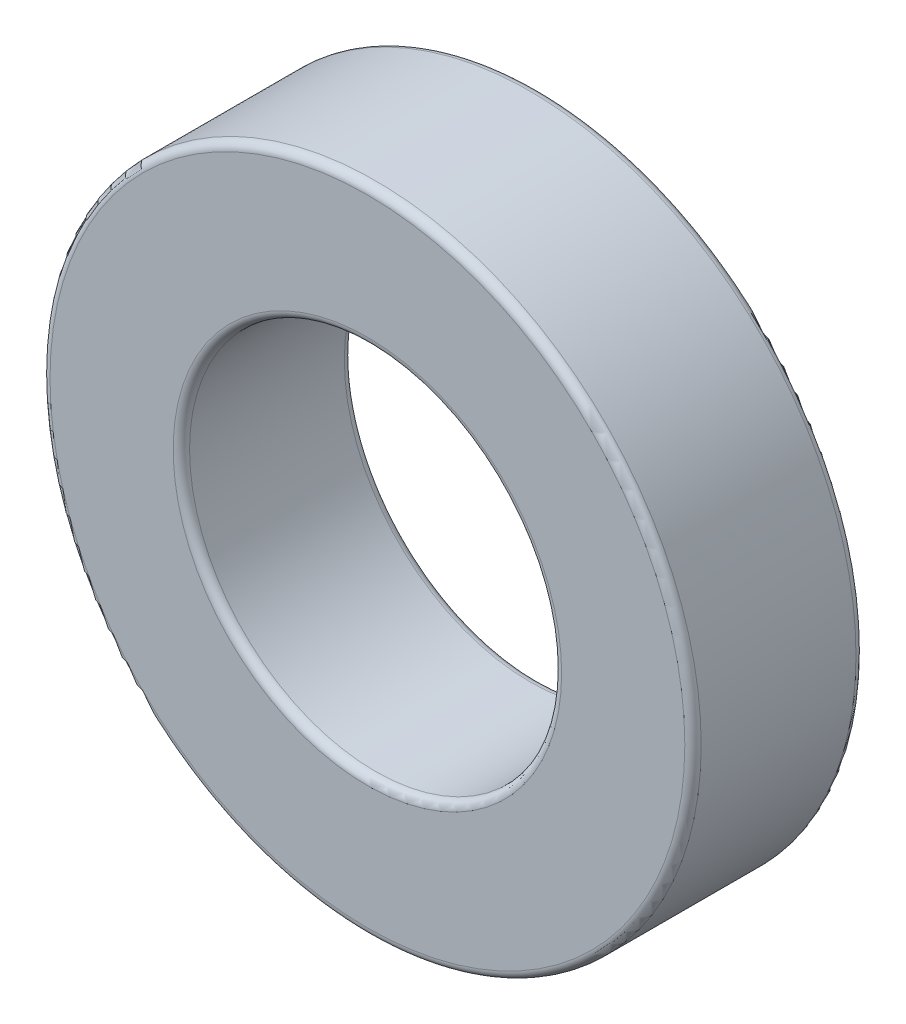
ISO-10303-21;
HEADER;
FILE_DESCRIPTION(('STEP AP214'),'2;1');
FILE_NAME('part.step','',(''),(''),'','','');
FILE_SCHEMA(('AUTOMOTIVE_DESIGN { 1 0 10303 214 1 1 1 1 }'));
ENDSEC;
DATA;
#1=APPLICATION_CONTEXT('core data for automotive mechanical design processes');
#2=APPLICATION_PROTOCOL_DEFINITION('international standard','automotive_design',2000,#1);
#3=PRODUCT_CONTEXT('',#1,'mechanical');
#4=PRODUCT('Part','Part','',(#3));
#5=PRODUCT_RELATED_PRODUCT_CATEGORY('part','',(#4));
#6=PRODUCT_DEFINITION_FORMATION('','',#4);
#7=PRODUCT_DEFINITION_CONTEXT('part definition',#1,'design');
#8=PRODUCT_DEFINITION('design','',#6,#7);
#9=PRODUCT_DEFINITION_SHAPE('','',#8);
#10=(LENGTH_UNIT() NAMED_UNIT(*) SI_UNIT(.MILLI.,.METRE.));
#11=(NAMED_UNIT(*) PLANE_ANGLE_UNIT() SI_UNIT($,.RADIAN.));
#12=(NAMED_UNIT(*) SI_UNIT($,.STERADIAN.) SOLID_ANGLE_UNIT());
#13=UNCERTAINTY_MEASURE_WITH_UNIT(LENGTH_MEASURE(1.E-05),#10,'distance_accuracy_value','');
#14=(GEOMETRIC_REPRESENTATION_CONTEXT(3) GLOBAL_UNCERTAINTY_ASSIGNED_CONTEXT((#13)) GLOBAL_UNIT_ASSIGNED_CONTEXT((#10,
#11,#12)) REPRESENTATION_CONTEXT('',''));
#15=CARTESIAN_POINT('',(0.,0.,0.));
#16=DIRECTION('',(0.,0.,1.));
#17=DIRECTION('',(1.,0.,0.));
#18=AXIS2_PLACEMENT_3D('',#15,#16,#17);
#19=CARTESIAN_POINT('',(0.,0.,-21.9));
#20=DIRECTION('',(0.,0.,1.));
#21=DIRECTION('',(1.,0.,0.));
#22=AXIS2_PLACEMENT_3D('',#19,#20,#21);
#23=TOROIDAL_SURFACE('',#22,42.65,1.1);
#24=CARTESIAN_POINT('',(0.,0.,-21.9));
#25=DIRECTION('',(0.,0.,1.));
#26=DIRECTION('',(1.,0.,0.));
#27=AXIS2_PLACEMENT_3D('',#24,#25,#26);
#28=CIRCLE('',#27,43.75);
#29=CARTESIAN_POINT('',(43.75,0.,-21.9));
#30=VERTEX_POINT('',#29);
#31=EDGE_CURVE('E10',#30,#30,#28,.T.);
#32=ORIENTED_EDGE('',*,*,#31,.F.);
#33=EDGE_LOOP('',(#32));
#34=FACE_BOUND('',#33,.T.);
#35=CARTESIAN_POINT('',(0.,0.,-23.));
#36=DIRECTION('',(0.,0.,1.));
#37=DIRECTION('',(1.,0.,0.));
#38=AXIS2_PLACEMENT_3D('',#35,#36,#37);
#39=CIRCLE('',#38,42.65);
#40=CARTESIAN_POINT('',(42.65,0.,-23.));
#41=VERTEX_POINT('',#40);
#42=EDGE_CURVE('E60',#41,#41,#39,.T.);
#43=ORIENTED_EDGE('',*,*,#42,.T.);
#44=EDGE_LOOP('',(#43));
#45=FACE_BOUND('',#44,.T.);
#46=ADVANCED_FACE('F32',(#34,#45),#23,.T.);
#47=CARTESIAN_POINT('',(0.,0.,80.));
#48=DIRECTION('',(0.,0.,1.));
#49=DIRECTION('',(1.,0.,0.));
#50=AXIS2_PLACEMENT_3D('',#47,#48,#49);
#51=CYLINDRICAL_SURFACE('',#50,43.75);
#52=ORIENTED_EDGE('',*,*,#31,.T.);
#53=EDGE_LOOP('',(#52));
#54=FACE_BOUND('',#53,.T.);
#55=CARTESIAN_POINT('',(0.,0.,-1.1));
#56=DIRECTION('',(0.,0.,1.));
#57=DIRECTION('',(1.,0.,0.));
#58=AXIS2_PLACEMENT_3D('',#55,#56,#57);
#59=CIRCLE('',#58,43.75);
#60=CARTESIAN_POINT('',(43.75,0.,-1.1));
#61=VERTEX_POINT('',#60);
#62=EDGE_CURVE('E38',#61,#61,#59,.T.);
#63=ORIENTED_EDGE('',*,*,#62,.F.);
#64=EDGE_LOOP('',(#63));
#65=FACE_BOUND('',#64,.T.);
#66=ADVANCED_FACE('F184',(#54,#65),#51,.T.);
#67=CARTESIAN_POINT('',(0.,0.,-1.1));
#68=DIRECTION('',(0.,0.,1.));
#69=DIRECTION('',(1.,0.,0.));
#70=AXIS2_PLACEMENT_3D('',#67,#68,#69);
#71=TOROIDAL_SURFACE('',#70,42.65,1.1);
#72=ORIENTED_EDGE('',*,*,#62,.T.);
#73=EDGE_LOOP('',(#72));
#74=FACE_BOUND('',#73,.T.);
#75=CARTESIAN_POINT('',(0.,0.,0.));
#76=DIRECTION('',(0.,0.,1.));
#77=DIRECTION('',(1.,0.,0.));
#78=AXIS2_PLACEMENT_3D('',#75,#76,#77);
#79=CIRCLE('',#78,42.65);
#80=CARTESIAN_POINT('',(42.65,0.,0.));
#81=VERTEX_POINT('',#80);
#82=EDGE_CURVE('E42',#81,#81,#79,.T.);
#83=ORIENTED_EDGE('',*,*,#82,.F.);
#84=EDGE_LOOP('',(#83));
#85=FACE_BOUND('',#84,.T.);
#86=ADVANCED_FACE('F181',(#74,#85),#71,.T.);
#87=CARTESIAN_POINT('',(-42.65,0.,0.));
#88=DIRECTION('',(0.,0.,-1.));
#89=DIRECTION('',(-1.,0.,0.));
#90=AXIS2_PLACEMENT_3D('',#87,#88,#89);
#91=PLANE('',#90);
#92=CARTESIAN_POINT('',(0.,0.,0.));
#93=DIRECTION('',(0.,0.,1.));
#94=DIRECTION('',(1.,0.,0.));
#95=AXIS2_PLACEMENT_3D('',#92,#93,#94);
#96=CIRCLE('',#95,26.1);
#97=CARTESIAN_POINT('',(26.1,0.,0.));
#98=VERTEX_POINT('',#97);
#99=EDGE_CURVE('E46',#98,#98,#96,.T.);
#100=ORIENTED_EDGE('',*,*,#99,.F.);
#101=EDGE_LOOP('',(#100));
#102=FACE_BOUND('',#101,.T.);
#103=ORIENTED_EDGE('',*,*,#82,.T.);
#104=EDGE_LOOP('',(#103));
#105=FACE_BOUND('',#104,.T.);
#106=ADVANCED_FACE('F177',(#102,#105),#91,.F.);
#107=CARTESIAN_POINT('',(0.,0.,-1.1));
#108=DIRECTION('',(0.,0.,1.));
#109=DIRECTION('',(1.,0.,0.));
#110=AXIS2_PLACEMENT_3D('',#107,#108,#109);
#111=TOROIDAL_SURFACE('',#110,26.1,1.1);
#112=CARTESIAN_POINT('',(0.,0.,-1.1));
#113=DIRECTION('',(0.,0.,1.));
#114=DIRECTION('',(1.,0.,0.));
#115=AXIS2_PLACEMENT_3D('',#112,#113,#114);
#116=CIRCLE('',#115,25.);
#117=CARTESIAN_POINT('',(25.,0.,-1.1));
#118=VERTEX_POINT('',#117);
#119=EDGE_CURVE('E51',#118,#118,#116,.T.);
#120=ORIENTED_EDGE('',*,*,#119,.F.);
#121=EDGE_LOOP('',(#120));
#122=FACE_BOUND('',#121,.T.);
#123=ORIENTED_EDGE('',*,*,#99,.T.);
#124=EDGE_LOOP('',(#123));
#125=FACE_BOUND('',#124,.T.);
#126=ADVANCED_FACE('F173',(#122,#125),#111,.T.);
#127=CARTESIAN_POINT('',(0.,0.,80.));
#128=DIRECTION('',(0.,0.,1.));
#129=DIRECTION('',(1.,0.,0.));
#130=AXIS2_PLACEMENT_3D('',#127,#128,#129);
#131=CYLINDRICAL_SURFACE('',#130,25.);
#132=CARTESIAN_POINT('',(0.,0.,-21.9));
#133=DIRECTION('',(0.,0.,1.));
#134=DIRECTION('',(1.,0.,0.));
#135=AXIS2_PLACEMENT_3D('',#132,#133,#134);
#136=CIRCLE('',#135,25.);
#137=CARTESIAN_POINT('',(25.,0.,-21.9));
#138=VERTEX_POINT('',#137);
#139=EDGE_CURVE('E54',#138,#138,#136,.T.);
#140=ORIENTED_EDGE('',*,*,#139,.F.);
#141=EDGE_LOOP('',(#140));
#142=FACE_BOUND('',#141,.T.);
#143=ORIENTED_EDGE('',*,*,#119,.T.);
#144=EDGE_LOOP('',(#143));
#145=FACE_BOUND('',#144,.T.);
#146=ADVANCED_FACE('F169',(#142,#145),#131,.F.);
#147=CARTESIAN_POINT('',(0.,0.,-21.9));
#148=DIRECTION('',(0.,0.,1.));
#149=DIRECTION('',(1.,0.,0.));
#150=AXIS2_PLACEMENT_3D('',#147,#148,#149);
#151=TOROIDAL_SURFACE('',#150,26.1,1.1);
#152=ORIENTED_EDGE('',*,*,#139,.T.);
#153=EDGE_LOOP('',(#152));
#154=FACE_BOUND('',#153,.T.);
#155=CARTESIAN_POINT('',(0.,0.,-23.));
#156=DIRECTION('',(0.,0.,1.));
#157=DIRECTION('',(1.,0.,0.));
#158=AXIS2_PLACEMENT_3D('',#155,#156,#157);
#159=CIRCLE('',#158,26.1);
#160=CARTESIAN_POINT('',(26.1,0.,-23.));
#161=VERTEX_POINT('',#160);
#162=EDGE_CURVE('E57',#161,#161,#159,.T.);
#163=ORIENTED_EDGE('',*,*,#162,.F.);
#164=EDGE_LOOP('',(#163));
#165=FACE_BOUND('',#164,.T.);
#166=ADVANCED_FACE('F165',(#154,#165),#151,.T.);
#167=CARTESIAN_POINT('',(-42.65,0.,-23.));
#168=DIRECTION('',(0.,0.,-1.));
#169=DIRECTION('',(-1.,0.,0.));
#170=AXIS2_PLACEMENT_3D('',#167,#168,#169);
#171=PLANE('',#170);
#172=ORIENTED_EDGE('',*,*,#162,.T.);
#173=EDGE_LOOP('',(#172));
#174=FACE_BOUND('',#173,.T.);
#175=ORIENTED_EDGE('',*,*,#42,.F.);
#176=EDGE_LOOP('',(#175));
#177=FACE_BOUND('',#176,.T.);
#178=ADVANCED_FACE('F162',(#174,#177),#171,.T.);
#179=CLOSED_SHELL('',(#46,#66,#86,#106,#126,#146,#166,#178));
#180=CARTESIAN_POINT('',(0.,0.,-11.5));
#181=DIRECTION('',(0.,0.,1.));
#182=DIRECTION('',(-1.,0.,0.));
#183=AXIS2_PLACEMENT_3D('',#180,#181,#182);
#184=SPHERICAL_SURFACE('',#183,35.);
#185=CARTESIAN_POINT('',(0.,0.,-22.99));
#186=DIRECTION('',(0.,0.,1.));
#187=DIRECTION('',(1.,0.,0.));
#188=AXIS2_PLACEMENT_3D('',#185,#186,#187);
#189=CIRCLE('',#188,33.060246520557);
#190=CARTESIAN_POINT('',(-33.060246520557,0.,-22.99));
#191=VERTEX_POINT('',#190);
#192=EDGE_CURVE('E63',#191,#191,#189,.T.);
#193=CARTESIAN_POINT('',(0.,0.,-0.00999999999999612));
#194=DIRECTION('',(0.,0.,1.));
#195=DIRECTION('',(1.,0.,0.));
#196=AXIS2_PLACEMENT_3D('',#193,#194,#195);
#197=CIRCLE('',#196,33.060246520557);
#198=CARTESIAN_POINT('',(-33.060246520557,0.,-0.00999999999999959));
#199=VERTEX_POINT('',#198);
#200=EDGE_CURVE('E72',#199,#199,#197,.T.);
#201=CARTESIAN_POINT('',(-33.060246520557,0.,-22.99));
#202=CARTESIAN_POINT('',(-33.1403149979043,0.,-22.7596197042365));
#203=CARTESIAN_POINT('',(-33.2179746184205,0.,-22.5284022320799));
#204=CARTESIAN_POINT('',(-33.3684438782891,0.,-22.0643945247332));
#205=CARTESIAN_POINT('',(-33.4412535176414,0.,-21.8316042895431));
#206=CARTESIAN_POINT('',(-33.5819905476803,0.,-21.3645526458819));
#207=CARTESIAN_POINT('',(-33.6499179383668,0.,-21.1302912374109));
#208=CARTESIAN_POINT('',(-33.7808609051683,0.,-20.6603996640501));
#209=CARTESIAN_POINT('',(-33.8438764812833,0.,-20.4247694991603));
#210=CARTESIAN_POINT('',(-33.9649682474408,0.,-19.9522433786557));
#211=CARTESIAN_POINT('',(-34.0230444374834,0.,-19.7153474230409));
#212=CARTESIAN_POINT('',(-34.1342320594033,0.,-19.2403932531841));
#213=CARTESIAN_POINT('',(-34.1873434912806,0.,-19.0023350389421));
#214=CARTESIAN_POINT('',(-34.2885783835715,0.,-18.5251603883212));
#215=CARTESIAN_POINT('',(-34.336701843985,0.,-18.2860439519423));
#216=CARTESIAN_POINT('',(-34.4279397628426,0.,-17.8068573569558));
#217=CARTESIAN_POINT('',(-34.4710542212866,0.,-17.5667871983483));
#218=CARTESIAN_POINT('',(-34.5522552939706,0.,-17.0857980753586));
#219=CARTESIAN_POINT('',(-34.5903419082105,0.,-16.8448791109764));
#220=CARTESIAN_POINT('',(-34.6614706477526,0.,-16.362297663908));
#221=CARTESIAN_POINT('',(-34.6945127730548,0.,-16.1206351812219));
#222=CARTESIAN_POINT('',(-34.7555380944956,0.,-15.636672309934));
#223=CARTESIAN_POINT('',(-34.7835212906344,0.,-15.3943719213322));
#224=CARTESIAN_POINT('',(-34.8344165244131,0.,-14.9092391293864));
#225=CARTESIAN_POINT('',(-34.8573285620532,0.,-14.6664067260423));
#226=CARTESIAN_POINT('',(-34.8980714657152,0.,-14.1803160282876));
#227=CARTESIAN_POINT('',(-34.9159023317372,0.,-13.937057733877));
#228=CARTESIAN_POINT('',(-34.9464750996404,0.,-13.4502215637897));
#229=CARTESIAN_POINT('',(-34.9592170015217,0.,-13.2066436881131));
#230=CARTESIAN_POINT('',(-34.9796062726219,0.,-12.7192748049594));
#231=CARTESIAN_POINT('',(-34.9872536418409,0.,-12.4754837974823));
#232=CARTESIAN_POINT('',(-34.9974505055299,0.,-11.9877951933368));
#233=CARTESIAN_POINT('',(-35.,0.,-11.7438975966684));
#234=CARTESIAN_POINT('',(-35.,0.,-11.2561024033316));
#235=CARTESIAN_POINT('',(-34.9974505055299,0.,-11.0122048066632));
#236=CARTESIAN_POINT('',(-34.9872536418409,0.,-10.5245162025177));
#237=CARTESIAN_POINT('',(-34.9796062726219,0.,-10.2807251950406));
#238=CARTESIAN_POINT('',(-34.9592170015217,0.,-9.79335631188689));
#239=CARTESIAN_POINT('',(-34.9464750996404,0.,-9.54977843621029));
#240=CARTESIAN_POINT('',(-34.9159023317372,0.,-9.06294226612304));
#241=CARTESIAN_POINT('',(-34.8980714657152,0.,-8.81968397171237));
#242=CARTESIAN_POINT('',(-34.8573285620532,0.,-8.33359327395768));
#243=CARTESIAN_POINT('',(-34.8344165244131,0.,-8.09076087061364));
#244=CARTESIAN_POINT('',(-34.7835212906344,0.,-7.6056280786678));
#245=CARTESIAN_POINT('',(-34.7555380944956,0.,-7.36332769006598));
#246=CARTESIAN_POINT('',(-34.6945127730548,0.,-6.87936481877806));
#247=CARTESIAN_POINT('',(-34.6614706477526,0.,-6.63770233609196));
#248=CARTESIAN_POINT('',(-34.5903419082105,0.,-6.15512088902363));
#249=CARTESIAN_POINT('',(-34.5522552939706,0.,-5.91420192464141));
#250=CARTESIAN_POINT('',(-34.4710542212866,0.,-5.43321280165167));
#251=CARTESIAN_POINT('',(-34.4279397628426,0.,-5.19314264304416));
#252=CARTESIAN_POINT('',(-34.336701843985,0.,-4.71395604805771));
#253=CARTESIAN_POINT('',(-34.2885783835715,0.,-4.47483961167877));
#254=CARTESIAN_POINT('',(-34.1873434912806,0.,-3.99766496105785));
#255=CARTESIAN_POINT('',(-34.1342320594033,0.,-3.75960674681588));
#256=CARTESIAN_POINT('',(-34.0230444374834,0.,-3.28465257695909));
#257=CARTESIAN_POINT('',(-33.9649682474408,0.,-3.04775662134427));
#258=CARTESIAN_POINT('',(-33.8438764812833,0.,-2.57523050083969));
#259=CARTESIAN_POINT('',(-33.7808609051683,0.,-2.33960033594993));
#260=CARTESIAN_POINT('',(-33.6499179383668,0.,-1.86970876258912));
#261=CARTESIAN_POINT('',(-33.5819905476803,0.,-1.63544735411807));
#262=CARTESIAN_POINT('',(-33.4412535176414,0.,-1.1683957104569));
#263=CARTESIAN_POINT('',(-33.3684438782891,0.,-0.935605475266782));
#264=CARTESIAN_POINT('',(-33.2179746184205,0.,-0.471597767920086));
#265=CARTESIAN_POINT('',(-33.1403149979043,0.,-0.240380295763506));
#266=CARTESIAN_POINT('',(-33.060246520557,0.,-0.00999999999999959));
#267=B_SPLINE_CURVE_WITH_KNOTS('',3,(#201,#202,#203,#204,#205,#206,#207,#208,#209,#210,#211,
#212,#213,#214,#215,#216,#217,#218,#219,#220,#221,#222,#223,#224,#225,#226,#227,#228,#229,#230,
#231,#232,#233,#234,#235,#236,#237,#238,#239,#240,#241,#242,#243,#244,#245,#246,#247,#248,#249,
#250,#251,#252,#253,#254,#255,#256,#257,#258,#259,#260,#261,#262,#263,#264,#265,#266),
.UNSPECIFIED.,.F.,.F.,(4,2,2,2,2,2,2,2,2,2,2,2,2,2,2,2,2,2,2,2,2,2,2,2,2,2,2,2,2,2,2,2,4),(0.,
0.731679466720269,1.46335893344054,2.19503840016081,2.92671786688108,3.65839733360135,
4.39007680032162,5.12175626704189,5.85343573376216,6.58511520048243,7.3167946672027,
8.04847413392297,8.78015360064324,9.51183306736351,10.2435125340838,10.9751920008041,
11.7068714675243,12.4385509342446,13.1702304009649,13.9019098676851,14.6335893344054,
15.3652688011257,16.0969482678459,16.8286277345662,17.5603072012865,18.2919866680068,
19.023666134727,19.7553456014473,20.4870250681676,21.2187045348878,21.9503840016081,
22.6820634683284,23.4137429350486),.UNSPECIFIED.);
#268=EDGE_CURVE('BSEAM157',#191,#199,#267,.T.);
#269=ORIENTED_EDGE('',*,*,#192,.F.);
#270=ORIENTED_EDGE('',*,*,#200,.T.);
#271=ORIENTED_EDGE('',*,*,#268,.T.);
#272=ORIENTED_EDGE('',*,*,#268,.F.);
#273=EDGE_LOOP('',(#269,#271,#270,#272));
#274=FACE_BOUND('',#273,.T.);
#275=ADVANCED_FACE('F157',(#274),#184,.F.);
#276=CARTESIAN_POINT('',(0.,0.,-22.99));
#277=DIRECTION('',(0.,0.,-1.));
#278=DIRECTION('',(-1.,0.,0.));
#279=AXIS2_PLACEMENT_3D('',#276,#277,#278);
#280=CONICAL_SURFACE('',#279,33.060246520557,1.23630819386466);
#281=CARTESIAN_POINT('',(0.,0.,-22.9867171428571));
#282=DIRECTION('',(0.,0.,1.));
#283=DIRECTION('',(1.,0.,0.));
#284=AXIS2_PLACEMENT_3D('',#281,#282,#283);
#285=CIRCLE('',#284,33.0508007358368);
#286=CARTESIAN_POINT('',(-33.0508007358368,0.,-22.9867171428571));
#287=VERTEX_POINT('',#286);
#288=EDGE_CURVE('E66',#287,#287,#285,.T.);
#289=ORIENTED_EDGE('',*,*,#288,.F.);
#290=EDGE_LOOP('',(#289));
#291=FACE_BOUND('',#290,.T.);
#292=ORIENTED_EDGE('',*,*,#192,.T.);
#293=EDGE_LOOP('',(#292));
#294=FACE_BOUND('',#293,.T.);
#295=ADVANCED_FACE('F153',(#291,#294),#280,.T.);
#296=CARTESIAN_POINT('',(0.,0.,-11.5));
#297=DIRECTION('',(0.,0.,1.));
#298=DIRECTION('',(-1.,0.,0.));
#299=AXIS2_PLACEMENT_3D('',#296,#297,#298);
#300=SPHERICAL_SURFACE('',#299,34.99);
#301=CARTESIAN_POINT('',(0.,0.,-0.0132828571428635));
#302=DIRECTION('',(0.,0.,1.));
#303=DIRECTION('',(1.,0.,0.));
#304=AXIS2_PLACEMENT_3D('',#301,#302,#303);
#305=CIRCLE('',#304,33.0508007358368);
#306=CARTESIAN_POINT('',(-33.0508007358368,0.,-0.0132828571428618));
#307=VERTEX_POINT('',#306);
#308=EDGE_CURVE('E69',#307,#307,#305,.T.);
#309=CARTESIAN_POINT('',(-33.0508007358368,0.,-22.9867171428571));
#310=CARTESIAN_POINT('',(-33.1308463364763,0.,-22.7564026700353));
#311=CARTESIAN_POINT('',(-33.2084837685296,0.,-22.5252512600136));
#312=CARTESIAN_POINT('',(-33.358910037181,0.,-22.0613761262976));
#313=CARTESIAN_POINT('',(-33.4316988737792,0.,-21.8286524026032));
#314=CARTESIAN_POINT('',(-33.5723956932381,0.,-21.3617342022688));
#315=CARTESIAN_POINT('',(-33.6403036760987,0.,-21.1275397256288));
#316=CARTESIAN_POINT('',(-33.771209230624,0.,-20.6577824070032));
#317=CARTESIAN_POINT('',(-33.8342068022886,0.,-20.4222195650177));
#318=CARTESIAN_POINT('',(-33.9552639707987,0.,-19.9498284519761));
#319=CARTESIAN_POINT('',(-34.0133235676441,0.,-19.71300018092));
#320=CARTESIAN_POINT('',(-34.124479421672,0.,-19.2381817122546));
#321=CARTESIAN_POINT('',(-34.1775756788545,0.,-19.0001915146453));
#322=CARTESIAN_POINT('',(-34.2787816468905,0.,-18.5231531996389));
#323=CARTESIAN_POINT('',(-34.3268913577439,0.,-18.2841050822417));
#324=CARTESIAN_POINT('',(-34.4181032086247,0.,-17.805055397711));
#325=CARTESIAN_POINT('',(-34.4612053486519,0.,-17.5650538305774));
#326=CARTESIAN_POINT('',(-34.5423832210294,0.,-17.0842021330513));
#327=CARTESIAN_POINT('',(-34.5804589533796,0.,-16.8433520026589));
#328=CARTESIAN_POINT('',(-34.6515673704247,0.,-16.3609084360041));
#329=CARTESIAN_POINT('',(-34.6846000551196,0.,-16.1193149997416));
#330=CARTESIAN_POINT('',(-34.7456079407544,0.,-15.6354904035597));
#331=CARTESIAN_POINT('',(-34.7735831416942,0.,-15.3932592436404));
#332=CARTESIAN_POINT('',(-34.8244638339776,0.,-14.9082650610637));
#333=CARTESIAN_POINT('',(-34.8473693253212,0.,-14.6655020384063));
#334=CARTESIAN_POINT('',(-34.8881005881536,0.,-14.1795502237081));
#335=CARTESIAN_POINT('',(-34.9059263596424,0.,-13.9363614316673));
#336=CARTESIAN_POINT('',(-34.9364903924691,0.,-13.4496643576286));
#337=CARTESIAN_POINT('',(-34.949228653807,0.,-13.2061560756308));
#338=CARTESIAN_POINT('',(-34.9696120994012,0.,-12.7189264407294));
#339=CARTESIAN_POINT('',(-34.9772572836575,0.,-12.4752050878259));
#340=CARTESIAN_POINT('',(-34.9874512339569,0.,-11.9876558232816));
#341=CARTESIAN_POINT('',(-34.99,0.,-11.7438279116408));
#342=CARTESIAN_POINT('',(-34.99,0.,-11.2561720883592));
#343=CARTESIAN_POINT('',(-34.9874512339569,0.,-11.0123441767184));
#344=CARTESIAN_POINT('',(-34.9772572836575,0.,-10.5247949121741));
#345=CARTESIAN_POINT('',(-34.9696120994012,0.,-10.2810735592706));
#346=CARTESIAN_POINT('',(-34.949228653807,0.,-9.7938439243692));
#347=CARTESIAN_POINT('',(-34.9364903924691,0.,-9.55033564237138));
#348=CARTESIAN_POINT('',(-34.9059263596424,0.,-9.06363856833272));
#349=CARTESIAN_POINT('',(-34.8881005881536,0.,-8.82044977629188));
#350=CARTESIAN_POINT('',(-34.8473693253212,0.,-8.33449796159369));
#351=CARTESIAN_POINT('',(-34.8244638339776,0.,-8.09173493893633));
#352=CARTESIAN_POINT('',(-34.7735831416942,0.,-7.60674075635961));
#353=CARTESIAN_POINT('',(-34.7456079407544,0.,-7.36450959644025));
#354=CARTESIAN_POINT('',(-34.6846000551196,0.,-6.88068500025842));
#355=CARTESIAN_POINT('',(-34.6515673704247,0.,-6.63909156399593));
#356=CARTESIAN_POINT('',(-34.5804589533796,0.,-6.15664799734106));
#357=CARTESIAN_POINT('',(-34.5423832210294,0.,-5.91579786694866));
#358=CARTESIAN_POINT('',(-34.4612053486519,0.,-5.43494616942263));
#359=CARTESIAN_POINT('',(-34.4181032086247,0.,-5.19494460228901));
#360=CARTESIAN_POINT('',(-34.3268913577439,0.,-4.71589491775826));
#361=CARTESIAN_POINT('',(-34.2787816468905,0.,-4.47684680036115));
#362=CARTESIAN_POINT('',(-34.1775756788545,0.,-3.9998084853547));
#363=CARTESIAN_POINT('',(-34.124479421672,0.,-3.76181828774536));
#364=CARTESIAN_POINT('',(-34.0133235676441,0.,-3.28699981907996));
#365=CARTESIAN_POINT('',(-33.9552639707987,0.,-3.05017154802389));
#366=CARTESIAN_POINT('',(-33.8342068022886,0.,-2.57778043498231));
#367=CARTESIAN_POINT('',(-33.771209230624,0.,-2.34221759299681));
#368=CARTESIAN_POINT('',(-33.6403036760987,0.,-1.87246027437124));
#369=CARTESIAN_POINT('',(-33.5723956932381,0.,-1.63826579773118));
#370=CARTESIAN_POINT('',(-33.4316988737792,0.,-1.17134759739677));
#371=CARTESIAN_POINT('',(-33.358910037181,0.,-0.938623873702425));
#372=CARTESIAN_POINT('',(-33.2084837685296,0.,-0.474748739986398));
#373=CARTESIAN_POINT('',(-33.1308463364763,0.,-0.243597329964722));
#374=CARTESIAN_POINT('',(-33.0508007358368,0.,-0.0132828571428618));
#375=B_SPLINE_CURVE_WITH_KNOTS('',3,(#309,#310,#311,#312,#313,#314,#315,#316,#317,#318,#319,
#320,#321,#322,#323,#324,#325,#326,#327,#328,#329,#330,#331,#332,#333,#334,#335,#336,#337,#338,
#339,#340,#341,#342,#343,#344,#345,#346,#347,#348,#349,#350,#351,#352,#353,#354,#355,#356,#357,
#358,#359,#360,#361,#362,#363,#364,#365,#366,#367,#368,#369,#370,#371,#372,#373,#374),
.UNSPECIFIED.,.F.,.F.,(4,2,2,2,2,2,2,2,2,2,2,2,2,2,2,2,2,2,2,2,2,2,2,2,2,2,2,2,2,2,2,2,4),(0.,
0.731470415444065,1.46294083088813,2.19441124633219,2.92588166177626,3.65735207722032,
4.38882249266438,5.12029290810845,5.85176332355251,6.58323373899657,7.31470415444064,
8.0461745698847,8.77764498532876,9.50911540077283,10.2405858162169,10.972056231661,
11.703526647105,12.4349970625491,13.1664674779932,13.8979378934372,14.6294083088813,
15.3608787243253,16.0923491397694,16.8238195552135,17.5552899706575,18.2867603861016,
19.0182308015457,19.7497012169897,20.4811716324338,21.2126420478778,21.9441124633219,
22.675582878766,23.40705329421),.UNSPECIFIED.);
#376=EDGE_CURVE('BSEAM149',#287,#307,#375,.T.);
#377=ORIENTED_EDGE('',*,*,#288,.T.);
#378=ORIENTED_EDGE('',*,*,#308,.F.);
#379=ORIENTED_EDGE('',*,*,#376,.T.);
#380=ORIENTED_EDGE('',*,*,#376,.F.);
#381=EDGE_LOOP('',(#377,#379,#378,#380));
#382=FACE_BOUND('',#381,.T.);
#383=ADVANCED_FACE('F149',(#382),#300,.T.);
#384=CARTESIAN_POINT('',(0.,0.,-0.00999999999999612));
#385=DIRECTION('',(0.,0.,1.));
#386=DIRECTION('',(1.,0.,0.));
#387=AXIS2_PLACEMENT_3D('',#384,#385,#386);
#388=CONICAL_SURFACE('',#387,33.060246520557,1.23630819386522);
#389=ORIENTED_EDGE('',*,*,#308,.T.);
#390=EDGE_LOOP('',(#389));
#391=FACE_BOUND('',#390,.T.);
#392=ORIENTED_EDGE('',*,*,#200,.F.);
#393=EDGE_LOOP('',(#392));
#394=FACE_BOUND('',#393,.T.);
#395=ADVANCED_FACE('F147',(#391,#394),#388,.T.);
#396=CLOSED_SHELL('',(#275,#295,#383,#395));
#397=CARTESIAN_POINT('',(0.,0.,-11.5));
#398=DIRECTION('',(0.,0.,1.));
#399=DIRECTION('',(-1.,0.,0.));
#400=AXIS2_PLACEMENT_3D('',#397,#398,#399);
#401=SPHERICAL_SURFACE('',#400,32.41);
#402=CARTESIAN_POINT('',(0.,0.,-8.51));
#403=DIRECTION('',(0.,0.,1.));
#404=DIRECTION('',(1.,0.,0.));
#405=AXIS2_PLACEMENT_3D('',#402,#403,#404);
#406=CIRCLE('',#405,32.2717833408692);
#407=CARTESIAN_POINT('',(-32.2717833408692,0.,-8.51));
#408=VERTEX_POINT('',#407);
#409=EDGE_CURVE('E75',#408,#408,#406,.T.);
#410=CARTESIAN_POINT('',(0.,0.,-2.99));
#411=DIRECTION('',(0.,0.,1.));
#412=DIRECTION('',(1.,0.,0.));
#413=AXIS2_PLACEMENT_3D('',#410,#411,#412);
#414=CIRCLE('',#413,31.2727996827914);
#415=CARTESIAN_POINT('',(-31.2727996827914,0.,-2.99));
#416=VERTEX_POINT('',#415);
#417=EDGE_CURVE('E84',#416,#416,#414,.T.);
#418=CARTESIAN_POINT('',(-32.2717833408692,0.,-8.51));
#419=CARTESIAN_POINT('',(-32.2663857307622,0.,-8.45174228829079));
#420=CARTESIAN_POINT('',(-32.2608303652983,0.,-8.39349919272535));
#421=CARTESIAN_POINT('',(-32.2494042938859,0.,-8.27704394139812));
#422=CARTESIAN_POINT('',(-32.2435335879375,0.,-8.21883178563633));
#423=CARTESIAN_POINT('',(-32.2314770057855,0.,-8.10244012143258));
#424=CARTESIAN_POINT('',(-32.2252911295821,0.,-8.04426061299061));
#425=CARTESIAN_POINT('',(-32.2126043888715,0.,-7.92793594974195));
#426=CARTESIAN_POINT('',(-32.2061035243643,0.,-7.86979079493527));
#427=CARTESIAN_POINT('',(-32.1927869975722,0.,-7.75353654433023));
#428=CARTESIAN_POINT('',(-32.1859713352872,0.,-7.69542744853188));
#429=CARTESIAN_POINT('',(-32.1720254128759,0.,-7.57924702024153));
#430=CARTESIAN_POINT('',(-32.1648951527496,0.,-7.52117568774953));
#431=CARTESIAN_POINT('',(-32.1503202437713,0.,-7.40507248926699));
#432=CARTESIAN_POINT('',(-32.1428755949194,0.,-7.34704062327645));
#433=CARTESIAN_POINT('',(-32.1276721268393,0.,-7.23101805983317));
#434=CARTESIAN_POINT('',(-32.1199133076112,0.,-7.17302736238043));
#435=CARTESIAN_POINT('',(-32.104081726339,0.,-7.05708883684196));
#436=CARTESIAN_POINT('',(-32.0960089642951,0.,-6.99914100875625));
#437=CARTESIAN_POINT('',(-32.0795497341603,0.,-6.88328992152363));
#438=CARTESIAN_POINT('',(-32.0711632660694,0.,-6.82538666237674));
#439=CARTESIAN_POINT('',(-32.0540768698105,0.,-6.70962641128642));
#440=CARTESIAN_POINT('',(-32.0453769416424,0.,-6.651769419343));
#441=CARTESIAN_POINT('',(-32.0276638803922,0.,-6.53610339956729));
#442=CARTESIAN_POINT('',(-32.0186507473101,0.,-6.47829437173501));
#443=CARTESIAN_POINT('',(-32.000311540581,0.,-6.36272597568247));
#444=CARTESIAN_POINT('',(-31.990985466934,0.,-6.30496660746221));
#445=CARTESIAN_POINT('',(-31.972020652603,0.,-6.18949922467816));
#446=CARTESIAN_POINT('',(-31.9623819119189,0.,-6.13179121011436));
#447=CARTESIAN_POINT('',(-31.9427920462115,0.,-6.01642822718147));
#448=CARTESIAN_POINT('',(-31.9328409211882,0.,-5.95877325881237));
#449=CARTESIAN_POINT('',(-31.9126265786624,0.,-5.84351805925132));
#450=CARTESIAN_POINT('',(-31.9023633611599,0.,-5.78591782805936));
#451=CARTESIAN_POINT('',(-31.8815251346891,0.,-5.67077379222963));
#452=CARTESIAN_POINT('',(-31.8709501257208,0.,-5.61322998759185));
#453=CARTESIAN_POINT('',(-31.8494886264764,0.,-5.49820049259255));
#454=CARTESIAN_POINT('',(-31.8386021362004,0.,-5.44071480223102));
#455=CARTESIAN_POINT('',(-31.8165179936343,0.,-5.32580322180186));
#456=CARTESIAN_POINT('',(-31.8053203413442,0.,-5.26837733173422));
#457=CARTESIAN_POINT('',(-31.7826142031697,0.,-5.15358703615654));
#458=CARTESIAN_POINT('',(-31.7711057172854,0.,-5.0962226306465));
#459=CARTESIAN_POINT('',(-31.7477782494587,0.,-4.98155698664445));
#460=CARTESIAN_POINT('',(-31.7359592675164,0.,-4.92425574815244));
#461=CARTESIAN_POINT('',(-31.7120111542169,0.,-4.80971811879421));
#462=CARTESIAN_POINT('',(-31.6998820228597,0.,-4.75248172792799));
#463=CARTESIAN_POINT('',(-31.6753139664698,0.,-4.6380754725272));
#464=CARTESIAN_POINT('',(-31.6628750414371,0.,-4.58090560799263));
#465=CARTESIAN_POINT('',(-31.6376877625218,0.,-4.46663408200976));
#466=CARTESIAN_POINT('',(-31.6249394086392,0.,-4.40953242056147));
#467=CARTESIAN_POINT('',(-31.5991336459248,0.,-4.29539897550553));
#468=CARTESIAN_POINT('',(-31.586076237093,0.,-4.23836719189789));
#469=CARTESIAN_POINT('',(-31.5596527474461,0.,-4.12437517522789));
#470=CARTESIAN_POINT('',(-31.546286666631,0.,-4.06741494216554));
#471=CARTESIAN_POINT('',(-31.5192462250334,0.,-3.95356769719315));
#472=CARTESIAN_POINT('',(-31.5055718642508,0.,-3.8966806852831));
#473=CARTESIAN_POINT('',(-31.4779152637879,0.,-3.78298155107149));
#474=CARTESIAN_POINT('',(-31.4639330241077,0.,-3.72616942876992));
#475=CARTESIAN_POINT('',(-31.4356610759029,0.,-3.6126217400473));
#476=CARTESIAN_POINT('',(-31.4213713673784,0.,-3.55588617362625));
#477=CARTESIAN_POINT('',(-31.3924849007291,0.,-3.44249326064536));
#478=CARTESIAN_POINT('',(-31.3778881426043,0.,-3.38583591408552));
#479=CARTESIAN_POINT('',(-31.3483880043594,0.,-3.27260110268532));
#480=CARTESIAN_POINT('',(-31.3334846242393,0.,-3.21602363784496));
#481=CARTESIAN_POINT('',(-31.3033716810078,0.,-3.1029502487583));
#482=CARTESIAN_POINT('',(-31.2881621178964,0.,-3.04645432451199));
#483=CARTESIAN_POINT('',(-31.2727996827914,0.,-2.99));
#484=B_SPLINE_CURVE_WITH_KNOTS('',3,(#418,#419,#420,#421,#422,#423,#424,#425,#426,#427,#428,
#429,#430,#431,#432,#433,#434,#435,#436,#437,#438,#439,#440,#441,#442,#443,#444,#445,#446,#447,
#448,#449,#450,#451,#452,#453,#454,#455,#456,#457,#458,#459,#460,#461,#462,#463,#464,#465,#466,
#467,#468,#469,#470,#471,#472,#473,#474,#475,#476,#477,#478,#479,#480,#481,#482,#483),
.UNSPECIFIED.,.F.,.F.,(4,2,2,2,2,2,2,2,2,2,2,2,2,2,2,2,2,2,2,2,2,2,2,2,2,2,2,2,2,2,2,2,4),(0.,
0.175521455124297,0.351042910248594,0.52656436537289,0.702085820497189,0.877607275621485,
1.05312873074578,1.22865018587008,1.40417164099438,1.57969309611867,1.75521455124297,
1.93073600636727,2.10625746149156,2.28177891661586,2.45730037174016,2.63282182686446,
2.80834328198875,2.98386473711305,3.15938619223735,3.33490764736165,3.51042910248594,
3.68595055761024,3.86147201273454,4.03699346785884,4.21251492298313,4.38803637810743,
4.56355783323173,4.73907928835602,4.91460074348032,5.09012219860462,5.26564365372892,
5.44116510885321,5.61668656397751),.UNSPECIFIED.);
#485=EDGE_CURVE('BSEAM130',#408,#416,#484,.T.);
#486=ORIENTED_EDGE('',*,*,#409,.F.);
#487=ORIENTED_EDGE('',*,*,#417,.T.);
#488=ORIENTED_EDGE('',*,*,#485,.T.);
#489=ORIENTED_EDGE('',*,*,#485,.F.);
#490=EDGE_LOOP('',(#486,#488,#487,#489));
#491=FACE_BOUND('',#490,.T.);
#492=ADVANCED_FACE('F130',(#491),#401,.F.);
#493=CARTESIAN_POINT('',(0.,0.,-8.51));
#494=DIRECTION('',(0.,0.,1.));
#495=DIRECTION('',(1.,0.,0.));
#496=AXIS2_PLACEMENT_3D('',#493,#494,#495);
#497=CONICAL_SURFACE('',#496,32.2717833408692,1.47840948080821);
#498=CARTESIAN_POINT('',(0.,0.,-8.51092255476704));
#499=DIRECTION('',(0.,0.,1.));
#500=DIRECTION('',(1.,0.,0.));
#501=AXIS2_PLACEMENT_3D('',#498,#499,#500);
#502=CIRCLE('',#501,32.2618259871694);
#503=CARTESIAN_POINT('',(-32.2618259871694,0.,-8.51092255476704));
#504=VERTEX_POINT('',#503);
#505=EDGE_CURVE('E78',#504,#504,#502,.T.);
#506=ORIENTED_EDGE('',*,*,#505,.F.);
#507=EDGE_LOOP('',(#506));
#508=FACE_BOUND('',#507,.T.);
#509=ORIENTED_EDGE('',*,*,#409,.T.);
#510=EDGE_LOOP('',(#509));
#511=FACE_BOUND('',#510,.T.);
#512=ADVANCED_FACE('F132',(#508,#511),#497,.F.);
#513=CARTESIAN_POINT('',(0.,0.,-11.5));
#514=DIRECTION('',(0.,0.,1.));
#515=DIRECTION('',(-1.,0.,0.));
#516=AXIS2_PLACEMENT_3D('',#513,#514,#515);
#517=SPHERICAL_SURFACE('',#516,32.4);
#518=CARTESIAN_POINT('',(0.,0.,-2.99262573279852));
#519=DIRECTION('',(0.,0.,1.));
#520=DIRECTION('',(1.,0.,0.));
#521=AXIS2_PLACEMENT_3D('',#518,#519,#520);
#522=CIRCLE('',#521,31.2631505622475);
#523=CARTESIAN_POINT('',(-31.2631505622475,0.,-2.99262573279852));
#524=VERTEX_POINT('',#523);
#525=EDGE_CURVE('E81',#524,#524,#522,.T.);
#526=CARTESIAN_POINT('',(-32.2618259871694,0.,-8.51092255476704));
#527=CARTESIAN_POINT('',(-32.2564300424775,0.,-8.45268281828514));
#528=CARTESIAN_POINT('',(-32.2508763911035,0.,-8.39445769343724));
#529=CARTESIAN_POINT('',(-32.2394538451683,0.,-8.27803837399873));
#530=CARTESIAN_POINT('',(-32.233584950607,0.,-8.21984417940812));
#531=CARTESIAN_POINT('',(-32.2215320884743,0.,-8.10348842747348));
#532=CARTESIAN_POINT('',(-32.2153481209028,0.,-8.04532687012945));
#533=CARTESIAN_POINT('',(-32.2026652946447,0.,-7.92903809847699));
#534=CARTESIAN_POINT('',(-32.1961664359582,0.,-7.87091088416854));
#535=CARTESIAN_POINT('',(-32.1828540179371,0.,-7.7546925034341));
#536=CARTESIAN_POINT('',(-32.1760404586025,0.,-7.69660133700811));
#537=CARTESIAN_POINT('',(-32.1620988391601,0.,-7.58045675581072));
#538=CARTESIAN_POINT('',(-32.1549707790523,0.,-7.52240334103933));
#539=CARTESIAN_POINT('',(-32.1404003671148,0.,-7.40633596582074));
#540=CARTESIAN_POINT('',(-32.132958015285,0.,-7.34832200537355));
#541=CARTESIAN_POINT('',(-32.1177592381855,0.,-7.23233524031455));
#542=CARTESIAN_POINT('',(-32.1100028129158,0.,-7.17436243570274));
#543=CARTESIAN_POINT('',(-32.0941761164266,0.,-7.05845968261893));
#544=CARTESIAN_POINT('',(-32.086105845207,0.,-7.00052973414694));
#545=CARTESIAN_POINT('',(-32.0696516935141,0.,-6.88471439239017));
#546=CARTESIAN_POINT('',(-32.0612678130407,0.,-6.8268289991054));
#547=CARTESIAN_POINT('',(-32.0441866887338,0.,-6.71110446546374));
#548=CARTESIAN_POINT('',(-32.0354894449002,0.,-6.65326532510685));
#549=CARTESIAN_POINT('',(-32.0177818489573,0.,-6.53763499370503));
#550=CARTESIAN_POINT('',(-32.0087714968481,0.,-6.47984380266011));
#551=CARTESIAN_POINT('',(-31.9904379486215,0.,-6.36431106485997));
#552=CARTESIAN_POINT('',(-31.9811147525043,0.,-6.30656951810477));
#553=CARTESIAN_POINT('',(-31.962155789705,0.,-6.19113776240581));
#554=CARTESIAN_POINT('',(-31.9525200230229,0.,-6.13344755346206));
#555=CARTESIAN_POINT('',(-31.9329362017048,0.,-6.01812016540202));
#556=CARTESIAN_POINT('',(-31.9229881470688,0.,-5.96048298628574));
#557=CARTESIAN_POINT('',(-31.9027800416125,0.,-5.84526334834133));
#558=CARTESIAN_POINT('',(-31.8925199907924,0.,-5.78768088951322));
#559=CARTESIAN_POINT('',(-31.8716881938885,0.,-5.67257238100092));
#560=CARTESIAN_POINT('',(-31.8611164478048,0.,-5.61504633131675));
#561=CARTESIAN_POINT('',(-31.8396615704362,0.,-5.50005232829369));
#562=CARTESIAN_POINT('',(-31.8287784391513,0.,-5.4425843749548));
#563=CARTESIAN_POINT('',(-31.8067011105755,0.,-5.32770825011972));
#564=CARTESIAN_POINT('',(-31.7955069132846,0.,-5.27030007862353));
#565=CARTESIAN_POINT('',(-31.7728077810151,0.,-5.15554520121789));
#566=CARTESIAN_POINT('',(-31.7613028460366,0.,-5.09819849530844));
#567=CARTESIAN_POINT('',(-31.7379825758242,0.,-4.98356823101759));
#568=CARTESIAN_POINT('',(-31.7261672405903,0.,-4.92628467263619));
#569=CARTESIAN_POINT('',(-31.7022265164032,0.,-4.81178238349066));
#570=CARTESIAN_POINT('',(-31.69010112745,0.,-4.75456365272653));
#571=CARTESIAN_POINT('',(-31.6655406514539,0.,-4.64019269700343));
#572=CARTESIAN_POINT('',(-31.653105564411,0.,-4.58304047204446));
#573=CARTESIAN_POINT('',(-31.6279260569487,0.,-4.46880420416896));
#574=CARTESIAN_POINT('',(-31.6151816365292,0.,-4.41172016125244));
#575=CARTESIAN_POINT('',(-31.5893838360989,0.,-4.29762193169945));
#576=CARTESIAN_POINT('',(-31.576330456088,0.,-4.24060774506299));
#577=CARTESIAN_POINT('',(-31.5499151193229,0.,-4.12665090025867));
#578=CARTESIAN_POINT('',(-31.5365531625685,0.,-4.06970824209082));
#579=CARTESIAN_POINT('',(-31.5095210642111,0.,-3.95589612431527));
#580=CARTESIAN_POINT('',(-31.495850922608,0.,-3.89902666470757));
#581=CARTESIAN_POINT('',(-31.4682028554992,0.,-3.78536261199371));
#582=CARTESIAN_POINT('',(-31.4542249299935,0.,-3.72856801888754));
#583=CARTESIAN_POINT('',(-31.4259617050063,0.,-3.61505536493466));
#584=CARTESIAN_POINT('',(-31.4116764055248,0.,-3.55833730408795));
#585=CARTESIAN_POINT('',(-31.3827988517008,0.,-3.44497937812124));
#586=CARTESIAN_POINT('',(-31.3682065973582,0.,-3.38833951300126));
#587=CARTESIAN_POINT('',(-31.338715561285,0.,-3.27513963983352));
#588=CARTESIAN_POINT('',(-31.3238167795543,0.,-3.21857963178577));
#589=CARTESIAN_POINT('',(-31.2937131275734,0.,-3.10554113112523));
#590=CARTESIAN_POINT('',(-31.2785082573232,0.,-3.04906263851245));
#591=CARTESIAN_POINT('',(-31.2631505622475,0.,-2.99262573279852));
#592=B_SPLINE_CURVE_WITH_KNOTS('',3,(#526,#527,#528,#529,#530,#531,#532,#533,#534,#535,#536,
#537,#538,#539,#540,#541,#542,#543,#544,#545,#546,#547,#548,#549,#550,#551,#552,#553,#554,#555,
#556,#557,#558,#559,#560,#561,#562,#563,#564,#565,#566,#567,#568,#569,#570,#571,#572,#573,#574,
#575,#576,#577,#578,#579,#580,#581,#582,#583,#584,#585,#586,#587,#588,#589,#590,#591),
.UNSPECIFIED.,.F.,.F.,(4,2,2,2,2,2,2,2,2,2,2,2,2,2,2,2,2,2,2,2,2,2,2,2,2,2,2,2,2,2,2,2,4),(0.,
0.175467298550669,0.35093459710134,0.52640189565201,0.701869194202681,0.87733649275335,
1.05280379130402,1.22827108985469,1.40373838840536,1.57920568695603,1.7546729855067,
1.93014028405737,2.10560758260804,2.28107488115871,2.45654217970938,2.63200947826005,
2.80747677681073,2.9829440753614,3.15841137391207,3.33387867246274,3.50934597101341,
3.68481326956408,3.86028056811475,4.03574786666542,4.21121516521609,4.38668246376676,
4.56214976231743,4.7376170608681,4.91308435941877,5.08855165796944,5.26401895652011,
5.43948625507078,5.61495355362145),.UNSPECIFIED.);
#593=EDGE_CURVE('BSEAM140',#504,#524,#592,.T.);
#594=ORIENTED_EDGE('',*,*,#505,.T.);
#595=ORIENTED_EDGE('',*,*,#525,.F.);
#596=ORIENTED_EDGE('',*,*,#593,.T.);
#597=ORIENTED_EDGE('',*,*,#593,.F.);
#598=EDGE_LOOP('',(#594,#596,#595,#597));
#599=FACE_BOUND('',#598,.T.);
#600=ADVANCED_FACE('F140',(#599),#517,.T.);
#601=CARTESIAN_POINT('',(0.,0.,-2.99));
#602=DIRECTION('',(0.,0.,1.));
#603=DIRECTION('',(1.,0.,0.));
#604=AXIS2_PLACEMENT_3D('',#601,#602,#603);
#605=CONICAL_SURFACE('',#604,31.2727996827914,1.3051082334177);
#606=ORIENTED_EDGE('',*,*,#525,.T.);
#607=EDGE_LOOP('',(#606));
#608=FACE_BOUND('',#607,.T.);
#609=ORIENTED_EDGE('',*,*,#417,.F.);
#610=EDGE_LOOP('',(#609));
#611=FACE_BOUND('',#610,.T.);
#612=ADVANCED_FACE('F279',(#608,#611),#605,.T.);
#613=CLOSED_SHELL('',(#492,#512,#600,#612));
#614=CARTESIAN_POINT('',(0.,0.,-11.5));
#615=DIRECTION('',(0.,0.,1.));
#616=DIRECTION('',(-1.,0.,0.));
#617=AXIS2_PLACEMENT_3D('',#614,#615,#616);
#618=SPHERICAL_SURFACE('',#617,32.39);
#619=CARTESIAN_POINT('',(0.,0.,-20.0073734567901));
#620=DIRECTION('',(0.,0.,1.));
#621=DIRECTION('',(1.,0.,0.));
#622=AXIS2_PLACEMENT_3D('',#619,#620,#621);
#623=CIRCLE('',#622,31.2527870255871);
#624=CARTESIAN_POINT('',(-31.2527870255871,0.,-20.0073734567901));
#625=VERTEX_POINT('',#624);
#626=EDGE_CURVE('E96',#625,#625,#623,.T.);
#627=CARTESIAN_POINT('',(0.,0.,-14.4890771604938));
#628=DIRECTION('',(0.,0.,1.));
#629=DIRECTION('',(1.,0.,0.));
#630=AXIS2_PLACEMENT_3D('',#627,#628,#629);
#631=CIRCLE('',#630,32.251783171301);
#632=CARTESIAN_POINT('',(-32.251783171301,0.,-14.4890771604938));
#633=VERTEX_POINT('',#632);
#634=EDGE_CURVE('E87',#633,#633,#631,.T.);
#635=CARTESIAN_POINT('',(-31.2527870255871,0.,-20.0073734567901));
#636=CARTESIAN_POINT('',(-31.2681496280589,0.,-19.9509372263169));
#637=CARTESIAN_POINT('',(-31.2833593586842,0.,-19.8944593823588));
#638=CARTESIAN_POINT('',(-31.3134726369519,0.,-19.7814221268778));
#639=CARTESIAN_POINT('',(-31.3283761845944,0.,-19.724862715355));
#640=CARTESIAN_POINT('',(-31.3578766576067,0.,-19.6116639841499));
#641=CARTESIAN_POINT('',(-31.3724735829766,0.,-19.5550246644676));
#642=CARTESIAN_POINT('',(-31.4013603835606,0.,-19.4416677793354));
#643=CARTESIAN_POINT('',(-31.4156502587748,0.,-19.3849502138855));
#644=CARTESIAN_POINT('',(-31.4439225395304,0.,-19.2714385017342));
#645=CARTESIAN_POINT('',(-31.4579049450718,0.,-19.2146443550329));
#646=CARTESIAN_POINT('',(-31.4855618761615,0.,-19.1009811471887));
#647=CARTESIAN_POINT('',(-31.4992364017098,0.,-19.0441120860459));
#648=CARTESIAN_POINT('',(-31.5262771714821,0.,-18.9303007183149));
#649=CARTESIAN_POINT('',(-31.5396434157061,0.,-18.8733584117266));
#650=CARTESIAN_POINT('',(-31.5660672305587,0.,-18.7594022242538));
#651=CARTESIAN_POINT('',(-31.5791248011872,0.,-18.7023883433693));
#652=CARTESIAN_POINT('',(-31.6049308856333,0.,-18.5882906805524));
#653=CARTESIAN_POINT('',(-31.6176793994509,0.,-18.5312068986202));
#654=CARTESIAN_POINT('',(-31.6428669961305,0.,-18.4169711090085));
#655=CARTESIAN_POINT('',(-31.6553060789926,0.,-18.3598191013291));
#656=CARTESIAN_POINT('',(-31.6798744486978,0.,-18.2454485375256));
#657=CARTESIAN_POINT('',(-31.692003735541,0.,-18.1882299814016));
#658=CARTESIAN_POINT('',(-31.715952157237,0.,-18.0737279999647));
#659=CARTESIAN_POINT('',(-31.7277712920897,0.,-18.0164445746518));
#660=CARTESIAN_POINT('',(-31.7510990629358,0.,-17.9018145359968));
#661=CARTESIAN_POINT('',(-31.7626076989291,0.,-17.8444679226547));
#662=CARTESIAN_POINT('',(-31.7853141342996,0.,-17.729713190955));
#663=CARTESIAN_POINT('',(-31.7965119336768,0.,-17.6723050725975));
#664=CARTESIAN_POINT('',(-31.8185963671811,0.,-17.5574290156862));
#665=CARTESIAN_POINT('',(-31.8294830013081,0.,-17.4999610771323));
#666=CARTESIAN_POINT('',(-31.85094478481,0.,-17.384967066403));
#667=CARTESIAN_POINT('',(-31.8615199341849,0.,-17.3274409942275));
#668=CARTESIAN_POINT('',(-31.882358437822,0.,-17.2123324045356));
#669=CARTESIAN_POINT('',(-31.8926217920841,0.,-17.1547498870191));
#670=CARTESIAN_POINT('',(-31.912836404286,0.,-17.0395300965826));
#671=CARTESIAN_POINT('',(-31.9227876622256,0.,-16.9818928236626));
#672=CARTESIAN_POINT('',(-31.9423777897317,0.,-16.8665652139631));
#673=CARTESIAN_POINT('',(-31.9520166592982,0.,-16.8088748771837));
#674=CARTESIAN_POINT('',(-31.9709817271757,0.,-16.6934428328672));
#675=CARTESIAN_POINT('',(-31.9803079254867,0.,-16.63570112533));
#676=CARTESIAN_POINT('',(-31.9986473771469,0.,-16.5201680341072));
#677=CARTESIAN_POINT('',(-32.0076606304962,0.,-16.4623766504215));
#678=CARTESIAN_POINT('',(-32.0253739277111,0.,-16.3467459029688));
#679=CARTESIAN_POINT('',(-32.0340739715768,0.,-16.2889065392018));
#680=CARTESIAN_POINT('',(-32.0511605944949,0.,-16.1731815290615));
#681=CARTESIAN_POINT('',(-32.0595471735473,0.,-16.1152958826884));
#682=CARTESIAN_POINT('',(-32.0760066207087,0.,-15.9994800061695));
#683=CARTESIAN_POINT('',(-32.0840794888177,0.,-15.9415497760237));
#684=CARTESIAN_POINT('',(-32.0999112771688,0.,-15.8256464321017));
#685=CARTESIAN_POINT('',(-32.1076701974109,0.,-15.7676733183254));
#686=CARTESIAN_POINT('',(-32.1228738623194,0.,-15.651685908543));
#687=CARTESIAN_POINT('',(-32.1303186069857,0.,-15.5936716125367));
#688=CARTESIAN_POINT('',(-32.144893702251,0.,-15.4776035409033));
#689=CARTESIAN_POINT('',(-32.1520240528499,0.,-15.4195497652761));
#690=CARTESIAN_POINT('',(-32.165970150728,0.,-15.3034044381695));
#691=CARTESIAN_POINT('',(-32.1727858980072,0.,-15.2453128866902));
#692=CARTESIAN_POINT('',(-32.1861025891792,0.,-15.129093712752));
#693=CARTESIAN_POINT('',(-32.192603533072,0.,-15.0709660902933));
#694=CARTESIAN_POINT('',(-32.2052904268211,0.,-14.9546764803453));
#695=CARTESIAN_POINT('',(-32.2114763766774,0.,-14.896514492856));
#696=CARTESIAN_POINT('',(-32.2235331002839,0.,-14.7801578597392));
#697=CARTESIAN_POINT('',(-32.2294038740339,0.,-14.7219632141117));
#698=CARTESIAN_POINT('',(-32.2408300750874,0.,-14.6055429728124));
#699=CARTESIAN_POINT('',(-32.2463855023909,0.,-14.5473173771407));
#700=CARTESIAN_POINT('',(-32.251783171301,0.,-14.4890771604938));
#701=B_SPLINE_CURVE_WITH_KNOTS('',3,(#635,#636,#637,#638,#639,#640,#641,#642,#643,#644,#645,
#646,#647,#648,#649,#650,#651,#652,#653,#654,#655,#656,#657,#658,#659,#660,#661,#662,#663,#664,
#665,#666,#667,#668,#669,#670,#671,#672,#673,#674,#675,#676,#677,#678,#679,#680,#681,#682,#683,
#684,#685,#686,#687,#688,#689,#690,#691,#692,#693,#694,#695,#696,#697,#698,#699,#700),
.UNSPECIFIED.,.F.,.F.,(4,2,2,2,2,2,2,2,2,2,2,2,2,2,2,2,2,2,2,2,2,2,2,2,2,2,2,2,2,2,2,2,4),(0.,
0.175469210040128,0.350938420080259,0.526407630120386,0.701876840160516,0.877346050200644,
1.05281526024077,1.2282844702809,1.40375368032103,1.57922289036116,1.75469210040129,
1.93016131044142,2.10563052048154,2.28109973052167,2.4565689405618,2.63203815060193,
2.80750736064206,2.98297657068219,3.15844578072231,3.33391499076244,3.50938420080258,
3.6848534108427,3.86032262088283,4.03579183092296,4.21126104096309,4.38673025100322,
4.56219946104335,4.73766867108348,4.9131378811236,5.08860709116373,5.26407630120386,
5.43954551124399,5.61501472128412),.UNSPECIFIED.);
#702=EDGE_CURVE('BSEAM100',#625,#633,#701,.T.);
#703=ORIENTED_EDGE('',*,*,#626,.T.);
#704=ORIENTED_EDGE('',*,*,#634,.F.);
#705=ORIENTED_EDGE('',*,*,#702,.T.);
#706=ORIENTED_EDGE('',*,*,#702,.F.);
#707=EDGE_LOOP('',(#703,#705,#704,#706));
#708=FACE_BOUND('',#707,.T.);
#709=ADVANCED_FACE('F100',(#708),#618,.T.);
#710=CARTESIAN_POINT('',(0.,0.,-14.49));
#711=DIRECTION('',(0.,0.,-1.));
#712=DIRECTION('',(-1.,0.,0.));
#713=AXIS2_PLACEMENT_3D('',#710,#711,#712);
#714=CONICAL_SURFACE('',#713,32.2617404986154,1.47838088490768);
#715=ORIENTED_EDGE('',*,*,#634,.T.);
#716=EDGE_LOOP('',(#715));
#717=FACE_BOUND('',#716,.T.);
#718=CARTESIAN_POINT('',(0.,0.,-14.49));
#719=DIRECTION('',(0.,0.,1.));
#720=DIRECTION('',(1.,0.,0.));
#721=AXIS2_PLACEMENT_3D('',#718,#719,#720);
#722=CIRCLE('',#721,32.2617404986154);
#723=CARTESIAN_POINT('',(-32.2617404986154,0.,-14.49));
#724=VERTEX_POINT('',#723);
#725=EDGE_CURVE('E90',#724,#724,#722,.T.);
#726=ORIENTED_EDGE('',*,*,#725,.F.);
#727=EDGE_LOOP('',(#726));
#728=FACE_BOUND('',#727,.T.);
#729=ADVANCED_FACE('F114',(#717,#728),#714,.F.);
#730=CARTESIAN_POINT('',(0.,0.,-11.5));
#731=DIRECTION('',(0.,0.,1.));
#732=DIRECTION('',(-1.,0.,0.));
#733=AXIS2_PLACEMENT_3D('',#730,#731,#732);
#734=SPHERICAL_SURFACE('',#733,32.4);
#735=CARTESIAN_POINT('',(0.,0.,-20.01));
#736=DIRECTION('',(0.,0.,1.));
#737=DIRECTION('',(1.,0.,0.));
#738=AXIS2_PLACEMENT_3D('',#735,#736,#737);
#739=CIRCLE('',#738,31.2624359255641);
#740=CARTESIAN_POINT('',(-31.2624359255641,0.,-20.01));
#741=VERTEX_POINT('',#740);
#742=EDGE_CURVE('E93',#741,#741,#739,.T.);
#743=CARTESIAN_POINT('',(-31.2624359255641,0.,-20.01));
#744=CARTESIAN_POINT('',(-31.2778032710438,0.,-19.9535463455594));
#745=CARTESIAN_POINT('',(-31.2930176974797,0.,-19.8970510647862));
#746=CARTESIAN_POINT('',(-31.3231402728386,0.,-19.7839789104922));
#747=CARTESIAN_POINT('',(-31.3380484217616,0.,-19.7274020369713));
#748=CARTESIAN_POINT('',(-31.3675580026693,0.,-19.6141683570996));
#749=CARTESIAN_POINT('',(-31.3821594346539,0.,-19.5575115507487));
#750=CARTESIAN_POINT('',(-31.4110551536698,0.,-19.4441196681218));
#751=CARTESIAN_POINT('',(-31.4253494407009,0.,-19.3873845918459));
#752=CARTESIAN_POINT('',(-31.4536304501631,0.,-19.2738378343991));
#753=CARTESIAN_POINT('',(-31.4676171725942,0.,-19.2170261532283));
#754=CARTESIAN_POINT('',(-31.4952826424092,0.,-19.1033278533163));
#755=CARTESIAN_POINT('',(-31.5089613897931,0.,-19.0464412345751));
#756=CARTESIAN_POINT('',(-31.5360105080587,0.,-18.9325947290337));
#757=CARTESIAN_POINT('',(-31.5493808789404,0.,-18.8756348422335));
#758=CARTESIAN_POINT('',(-31.5758128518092,0.,-18.7616434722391));
#759=CARTESIAN_POINT('',(-31.5888744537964,0.,-18.7046119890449));
#760=CARTESIAN_POINT('',(-31.6146885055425,0.,-18.5904791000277));
#761=CARTESIAN_POINT('',(-31.6274409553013,0.,-18.5333776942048));
#762=CARTESIAN_POINT('',(-31.6526363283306,0.,-18.419106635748));
#763=CARTESIAN_POINT('',(-31.6650792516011,0.,-18.361936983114));
#764=CARTESIAN_POINT('',(-31.6896552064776,0.,-18.2475311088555));
#765=CARTESIAN_POINT('',(-31.7017882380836,0.,-18.190294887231));
#766=CARTESIAN_POINT('',(-31.7257440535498,0.,-18.0757575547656));
#767=CARTESIAN_POINT('',(-31.7375668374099,0.,-18.0184564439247));
#768=CARTESIAN_POINT('',(-31.7609018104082,0.,-17.9037910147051));
#769=CARTESIAN_POINT('',(-31.7724139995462,0.,-17.8464266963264));
#770=CARTESIAN_POINT('',(-31.7951274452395,0.,-17.7316365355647));
#771=CARTESIAN_POINT('',(-31.8063287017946,0.,-17.6742106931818));
#772=CARTESIAN_POINT('',(-31.8284199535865,0.,-17.5592991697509));
#773=CARTESIAN_POINT('',(-31.8393099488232,0.,-17.5018134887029));
#774=CARTESIAN_POINT('',(-31.8607783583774,0.,-17.3867839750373));
#775=CARTESIAN_POINT('',(-31.871356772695,0.,-17.3292401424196));
#776=CARTESIAN_POINT('',(-31.8922017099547,0.,-17.2140960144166));
#777=CARTESIAN_POINT('',(-31.9024682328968,0.,-17.1564957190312));
#778=CARTESIAN_POINT('',(-31.9226890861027,0.,-17.0412403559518));
#779=CARTESIAN_POINT('',(-31.9326434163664,0.,-16.9835852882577));
#780=CARTESIAN_POINT('',(-31.9522395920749,0.,-16.8682220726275));
#781=CARTESIAN_POINT('',(-31.9618814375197,0.,-16.8105139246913));
#782=CARTESIAN_POINT('',(-31.9808523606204,0.,-16.6950462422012));
#783=CARTESIAN_POINT('',(-31.9901814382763,0.,-16.6372867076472));
#784=CARTESIAN_POINT('',(-32.0085265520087,0.,-16.5217179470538));
#785=CARTESIAN_POINT('',(-32.0175425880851,0.,-16.4639087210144));
#786=CARTESIAN_POINT('',(-32.035261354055,0.,-16.348242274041));
#787=CARTESIAN_POINT('',(-32.0439640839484,0.,-16.290385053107));
#788=CARTESIAN_POINT('',(-32.0610559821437,0.,-16.1746243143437));
#789=CARTESIAN_POINT('',(-32.0694451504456,0.,-16.1167207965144));
#790=CARTESIAN_POINT('',(-32.0859096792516,0.,-16.0008691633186));
#791=CARTESIAN_POINT('',(-32.0939850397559,0.,-15.9429210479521));
#792=CARTESIAN_POINT('',(-32.10982171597,0.,-15.8269819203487));
#793=CARTESIAN_POINT('',(-32.1175830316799,0.,-15.7689909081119));
#794=CARTESIAN_POINT('',(-32.1327913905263,0.,-15.6529676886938));
#795=CARTESIAN_POINT('',(-32.1402384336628,0.,-15.5949354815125));
#796=CARTESIAN_POINT('',(-32.1548180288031,0.,-15.4788315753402));
#797=CARTESIAN_POINT('',(-32.1619505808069,0.,-15.4207598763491));
#798=CARTESIAN_POINT('',(-32.1759009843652,0.,-15.3045786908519));
#799=CARTESIAN_POINT('',(-32.1827188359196,0.,-15.2464692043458));
#800=CARTESIAN_POINT('',(-32.1960396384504,0.,-15.1302141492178));
#801=CARTESIAN_POINT('',(-32.2025425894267,0.,-15.0720685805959));
#802=CARTESIAN_POINT('',(-32.2152334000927,0.,-14.9557430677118));
#803=CARTESIAN_POINT('',(-32.2214212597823,0.,-14.8975631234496));
#804=CARTESIAN_POINT('',(-32.2334817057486,0.,-14.7811705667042));
#805=CARTESIAN_POINT('',(-32.2393542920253,0.,-14.722957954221));
#806=CARTESIAN_POINT('',(-32.2507840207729,0.,-14.6065017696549));
#807=CARTESIAN_POINT('',(-32.2563411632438,0.,-14.548258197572));
#808=CARTESIAN_POINT('',(-32.2617404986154,0.,-14.49));
#809=B_SPLINE_CURVE_WITH_KNOTS('',3,(#743,#744,#745,#746,#747,#748,#749,#750,#751,#752,#753,
#754,#755,#756,#757,#758,#759,#760,#761,#762,#763,#764,#765,#766,#767,#768,#769,#770,#771,#772,
#773,#774,#775,#776,#777,#778,#779,#780,#781,#782,#783,#784,#785,#786,#787,#788,#789,#790,#791,
#792,#793,#794,#795,#796,#797,#798,#799,#800,#801,#802,#803,#804,#805,#806,#807,#808),
.UNSPECIFIED.,.F.,.F.,(4,2,2,2,2,2,2,2,2,2,2,2,2,2,2,2,2,2,2,2,2,2,2,2,2,2,2,2,2,2,2,2,4),(0.,
0.175523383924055,0.351046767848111,0.526570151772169,0.702093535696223,0.87761691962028,
1.05314030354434,1.22866368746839,1.40418707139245,1.5797104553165,1.75523383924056,
1.93075722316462,2.10628060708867,2.28180399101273,2.45732737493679,2.63285075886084,
2.8083741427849,2.98389752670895,3.15942091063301,3.33494429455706,3.51046767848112,
3.68599106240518,3.86151444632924,4.03703783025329,4.21256121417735,4.3880845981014,
4.56360798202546,4.73913136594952,4.91465474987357,5.09017813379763,5.26570151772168,
5.44122490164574,5.6167482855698),.UNSPECIFIED.);
#810=EDGE_CURVE('BSEAM106',#741,#724,#809,.T.);
#811=ORIENTED_EDGE('',*,*,#742,.F.);
#812=ORIENTED_EDGE('',*,*,#725,.T.);
#813=ORIENTED_EDGE('',*,*,#810,.T.);
#814=ORIENTED_EDGE('',*,*,#810,.F.);
#815=EDGE_LOOP('',(#811,#813,#812,#814));
#816=FACE_BOUND('',#815,.T.);
#817=ADVANCED_FACE('F106',(#816),#734,.F.);
#818=CARTESIAN_POINT('',(0.,0.,-20.01));
#819=DIRECTION('',(0.,0.,-1.));
#820=DIRECTION('',(-1.,0.,0.));
#821=AXIS2_PLACEMENT_3D('',#818,#819,#820);
#822=CONICAL_SURFACE('',#821,31.2624359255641,1.30502424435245);
#823=ORIENTED_EDGE('',*,*,#626,.F.);
#824=EDGE_LOOP('',(#823));
#825=FACE_BOUND('',#824,.T.);
#826=ORIENTED_EDGE('',*,*,#742,.T.);
#827=EDGE_LOOP('',(#826));
#828=FACE_BOUND('',#827,.T.);
#829=ADVANCED_FACE('F103',(#825,#828),#822,.T.);
#830=CLOSED_SHELL('',(#709,#729,#817,#829));
#831=ORIENTED_CLOSED_SHELL('',*,#396,.T.);
#832=ORIENTED_CLOSED_SHELL('',*,#613,.T.);
#833=ORIENTED_CLOSED_SHELL('',*,#830,.T.);
#834=BREP_WITH_VOIDS('B2',#179,(#831,#832,#833));
#835=ADVANCED_BREP_SHAPE_REPRESENTATION('',(#18,#834),#14);
#836=SHAPE_DEFINITION_REPRESENTATION(#9,#835);
ENDSEC;
END-ISO-10303-21;
